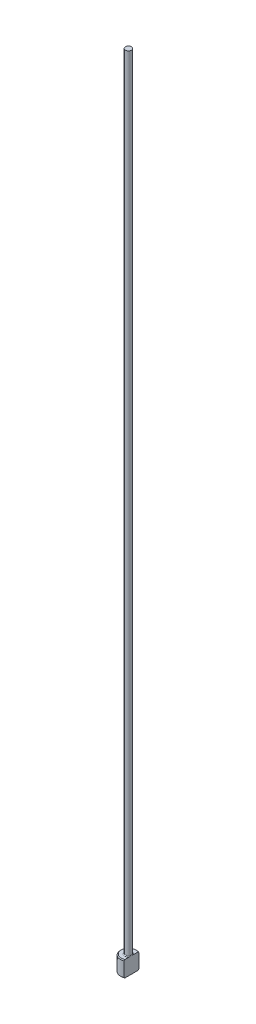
from build123d import *
from build123d.topology import SkipClean

# Parameters (mm, degrees)
CHAMFER1_SIZE    = 0.2
FILLET1_R        = 0.2
KEYED_HEAD_DEPTH = 201.019999


with BuildPart() as part:
    # Sketch1 → Revolve1 (revolve)
    with BuildSketch(Plane.XY, mode=Mode.PRIVATE) as revolve1_sk:
        Polygon((0, 0), (-2, 0), (-2, 4), (-0.75, 4), (-0.75, 200), (0, 200), align=None)
    revolve(revolve1_sk.sketch.rotate(Axis((0, 259.958771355, 0), (0, -1, 0)), 270), axis=Axis((0, 259.958771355, 0), (0, -1, 0)))

    # Chamfer1
    chamfer1_edges = [part.edges().sort_by_distance(p)[0] for p in [
        (0, 4, -2),
        (0, 0, -2),
    ]]
    chamfer(chamfer1_edges, length=CHAMFER1_SIZE)

    # Fillet1
    fillet1_edges = [part.edges().sort_by_distance(p)[0] for p in [
        (0, 4, -0.75),
    ]]
    fillet(fillet1_edges, radius=FILLET1_R)

    # Sketch2 → KEYED HEAD (cut, through all)
    with SkipClean():  # the faces are left unmerged after this step: merging them gives an invalid solid
        with BuildSketch(Plane(origin=(0, 0, 0), x_dir=(1, 0, 0), z_dir=(0, 1, 0))):
            with BuildLine():
                Line((0.75, -1.854049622), (0.75, 1.854049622))
                ThreePointArc((0.75, 1.854049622), (2, 0), (0.75, -1.854049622))
            make_face()
        extrude(amount=KEYED_HEAD_DEPTH, mode=Mode.SUBTRACT)


solid = part.part
